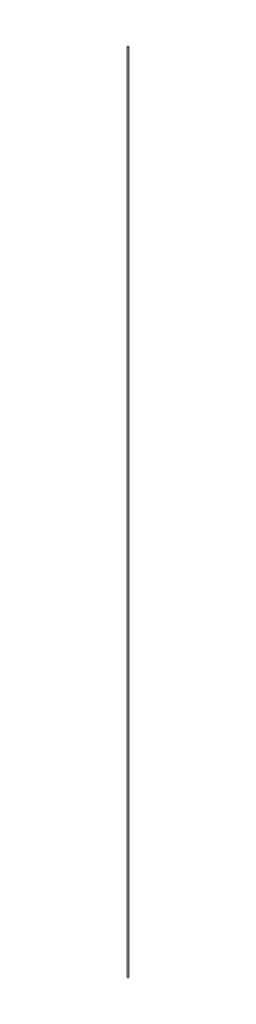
ISO-10303-21;
HEADER;
FILE_DESCRIPTION(('STEP AP214'),'2;1');
FILE_NAME('part.step','',(''),(''),'','','');
FILE_SCHEMA(('AUTOMOTIVE_DESIGN { 1 0 10303 214 1 1 1 1 }'));
ENDSEC;
DATA;
#1=APPLICATION_CONTEXT('core data for automotive mechanical design processes');
#2=APPLICATION_PROTOCOL_DEFINITION('international standard','automotive_design',2000,#1);
#3=PRODUCT_CONTEXT('',#1,'mechanical');
#4=PRODUCT('Part','Part','',(#3));
#5=PRODUCT_RELATED_PRODUCT_CATEGORY('part','',(#4));
#6=PRODUCT_DEFINITION_FORMATION('','',#4);
#7=PRODUCT_DEFINITION_CONTEXT('part definition',#1,'design');
#8=PRODUCT_DEFINITION('design','',#6,#7);
#9=PRODUCT_DEFINITION_SHAPE('','',#8);
#10=(LENGTH_UNIT() NAMED_UNIT(*) SI_UNIT(.MILLI.,.METRE.));
#11=(NAMED_UNIT(*) PLANE_ANGLE_UNIT() SI_UNIT($,.RADIAN.));
#12=(NAMED_UNIT(*) SI_UNIT($,.STERADIAN.) SOLID_ANGLE_UNIT());
#13=UNCERTAINTY_MEASURE_WITH_UNIT(LENGTH_MEASURE(1.E-05),#10,'distance_accuracy_value','');
#14=(GEOMETRIC_REPRESENTATION_CONTEXT(3) GLOBAL_UNCERTAINTY_ASSIGNED_CONTEXT((#13)) GLOBAL_UNIT_ASSIGNED_CONTEXT((#10,
#11,#12)) REPRESENTATION_CONTEXT('',''));
#15=CARTESIAN_POINT('',(0.,0.,0.));
#16=DIRECTION('',(0.,0.,1.));
#17=DIRECTION('',(1.,0.,0.));
#18=AXIS2_PLACEMENT_3D('',#15,#16,#17);
#19=CARTESIAN_POINT('',(0.,200.,0.));
#20=DIRECTION('',(0.,-1.,0.));
#21=DIRECTION('',(0.,0.,-1.));
#22=AXIS2_PLACEMENT_3D('',#19,#20,#21);
#23=CYLINDRICAL_SURFACE('',#22,0.15);
#24=CARTESIAN_POINT('',(0.,200.,0.));
#25=DIRECTION('',(0.,1.,0.));
#26=DIRECTION('',(0.,0.,1.));
#27=AXIS2_PLACEMENT_3D('',#24,#25,#26);
#28=CIRCLE('',#27,0.15);
#29=CARTESIAN_POINT('',(0.,200.,0.15));
#30=VERTEX_POINT('',#29);
#31=EDGE_CURVE('E10',#30,#30,#28,.T.);
#32=ORIENTED_EDGE('',*,*,#31,.F.);
#33=EDGE_LOOP('',(#32));
#34=FACE_BOUND('',#33,.T.);
#35=CARTESIAN_POINT('',(0.,0.,0.));
#36=DIRECTION('',(0.,1.,0.));
#37=DIRECTION('',(0.,0.,1.));
#38=AXIS2_PLACEMENT_3D('',#35,#36,#37);
#39=CIRCLE('',#38,0.15);
#40=CARTESIAN_POINT('',(0.,0.,0.15));
#41=VERTEX_POINT('',#40);
#42=EDGE_CURVE('E44',#41,#41,#39,.T.);
#43=ORIENTED_EDGE('',*,*,#42,.T.);
#44=EDGE_LOOP('',(#43));
#45=FACE_BOUND('',#44,.T.);
#46=ADVANCED_FACE('F41',(#34,#45),#23,.T.);
#47=CARTESIAN_POINT('',(0.,200.,0.));
#48=DIRECTION('',(0.,1.,0.));
#49=DIRECTION('',(0.,0.,1.));
#50=AXIS2_PLACEMENT_3D('',#47,#48,#49);
#51=PLANE('',#50);
#52=ORIENTED_EDGE('',*,*,#31,.T.);
#53=EDGE_LOOP('',(#52));
#54=FACE_BOUND('',#53,.T.);
#55=ADVANCED_FACE('F58',(#54),#51,.T.);
#56=CARTESIAN_POINT('',(0.,0.,0.));
#57=DIRECTION('',(0.,1.,0.));
#58=DIRECTION('',(0.,0.,1.));
#59=AXIS2_PLACEMENT_3D('',#56,#57,#58);
#60=PLANE('',#59);
#61=ORIENTED_EDGE('',*,*,#42,.F.);
#62=EDGE_LOOP('',(#61));
#63=FACE_BOUND('',#62,.T.);
#64=ADVANCED_FACE('F56',(#63),#60,.F.);
#65=CLOSED_SHELL('',(#46,#55,#64));
#66=MANIFOLD_SOLID_BREP('B2',#65);
#67=ADVANCED_BREP_SHAPE_REPRESENTATION('',(#18,#66),#14);
#68=SHAPE_DEFINITION_REPRESENTATION(#9,#67);
ENDSEC;
END-ISO-10303-21;
